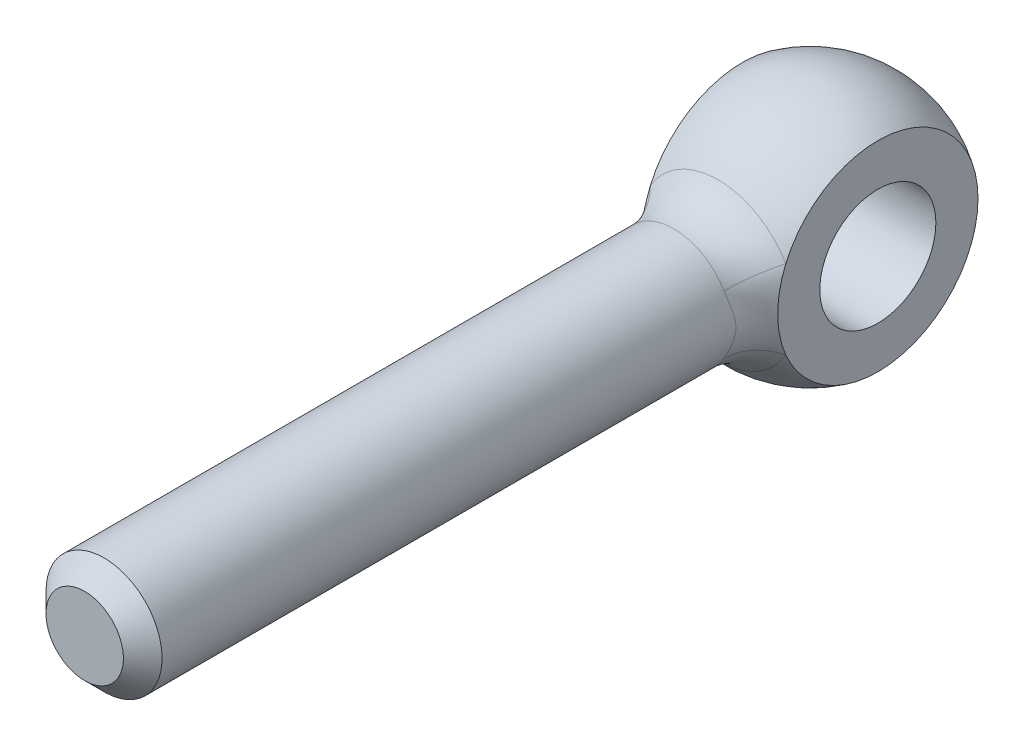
ISO-10303-21;
HEADER;
FILE_DESCRIPTION(('STEP AP214'),'2;1');
FILE_NAME('part.step','',(''),(''),'','','');
FILE_SCHEMA(('AUTOMOTIVE_DESIGN { 1 0 10303 214 1 1 1 1 }'));
ENDSEC;
DATA;
#1=APPLICATION_CONTEXT('core data for automotive mechanical design processes');
#2=APPLICATION_PROTOCOL_DEFINITION('international standard','automotive_design',2000,#1);
#3=PRODUCT_CONTEXT('',#1,'mechanical');
#4=PRODUCT('Part','Part','',(#3));
#5=PRODUCT_RELATED_PRODUCT_CATEGORY('part','',(#4));
#6=PRODUCT_DEFINITION_FORMATION('','',#4);
#7=PRODUCT_DEFINITION_CONTEXT('part definition',#1,'design');
#8=PRODUCT_DEFINITION('design','',#6,#7);
#9=PRODUCT_DEFINITION_SHAPE('','',#8);
#10=(LENGTH_UNIT() NAMED_UNIT(*) SI_UNIT(.MILLI.,.METRE.));
#11=(NAMED_UNIT(*) PLANE_ANGLE_UNIT() SI_UNIT($,.RADIAN.));
#12=(NAMED_UNIT(*) SI_UNIT($,.STERADIAN.) SOLID_ANGLE_UNIT());
#13=UNCERTAINTY_MEASURE_WITH_UNIT(LENGTH_MEASURE(1.E-05),#10,'distance_accuracy_value','');
#14=(GEOMETRIC_REPRESENTATION_CONTEXT(3) GLOBAL_UNCERTAINTY_ASSIGNED_CONTEXT((#13)) GLOBAL_UNIT_ASSIGNED_CONTEXT((#10,
#11,#12)) REPRESENTATION_CONTEXT('',''));
#15=CARTESIAN_POINT('',(0.,0.,0.));
#16=DIRECTION('',(0.,0.,1.));
#17=DIRECTION('',(1.,0.,0.));
#18=AXIS2_PLACEMENT_3D('',#15,#16,#17);
#19=CARTESIAN_POINT('',(0.,0.,0.));
#20=DIRECTION('',(1.,0.,0.));
#21=DIRECTION('',(0.,0.,-1.));
#22=AXIS2_PLACEMENT_3D('',#19,#20,#21);
#23=SPHERICAL_SURFACE('',#22,12.5);
#24=CARTESIAN_POINT('',(-7.,0.,0.));
#25=DIRECTION('',(-1.,0.,0.));
#26=DIRECTION('',(0.,0.,1.));
#27=AXIS2_PLACEMENT_3D('',#24,#25,#26);
#28=CIRCLE('',#27,10.356157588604);
#29=CARTESIAN_POINT('',(-7.,-4.09162768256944,9.51359989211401));
#30=VERTEX_POINT('',#29);
#31=CARTESIAN_POINT('',(-7.,4.09162768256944,9.51359989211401));
#32=VERTEX_POINT('',#31);
#33=EDGE_CURVE('E65',#30,#32,#28,.F.);
#34=ORIENTED_EDGE('',*,*,#33,.T.);
#35=CARTESIAN_POINT('',(0.,0.,9.51359989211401));
#36=DIRECTION('',(0.,0.,-1.));
#37=DIRECTION('',(-1.,0.,0.));
#38=AXIS2_PLACEMENT_3D('',#35,#36,#37);
#39=CIRCLE('',#38,8.10810810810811);
#40=CARTESIAN_POINT('',(7.,4.09162768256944,9.51359989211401));
#41=VERTEX_POINT('',#40);
#42=EDGE_CURVE('E73',#32,#41,#39,.T.);
#43=ORIENTED_EDGE('',*,*,#42,.T.);
#44=CARTESIAN_POINT('',(7.,0.,0.));
#45=DIRECTION('',(-1.,0.,0.));
#46=DIRECTION('',(0.,0.,1.));
#47=AXIS2_PLACEMENT_3D('',#44,#45,#46);
#48=CIRCLE('',#47,10.356157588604);
#49=CARTESIAN_POINT('',(7.,-4.09162768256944,9.51359989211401));
#50=VERTEX_POINT('',#49);
#51=EDGE_CURVE('E61',#50,#41,#48,.F.);
#52=ORIENTED_EDGE('',*,*,#51,.F.);
#53=CARTESIAN_POINT('',(0.,0.,9.51359989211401));
#54=DIRECTION('',(0.,0.,-1.));
#55=DIRECTION('',(-1.,0.,0.));
#56=AXIS2_PLACEMENT_3D('',#53,#54,#55);
#57=CIRCLE('',#56,8.10810810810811);
#58=EDGE_CURVE('E70',#50,#30,#57,.T.);
#59=ORIENTED_EDGE('',*,*,#58,.T.);
#60=EDGE_LOOP('',(#34,#43,#52,#59));
#61=FACE_BOUND('',#60,.T.);
#62=ADVANCED_FACE('F14',(#61),#23,.T.);
#63=CARTESIAN_POINT('',(0.,0.,-10.));
#64=DIRECTION('',(0.,0.,-1.));
#65=DIRECTION('',(-1.,0.,0.));
#66=AXIS2_PLACEMENT_3D('',#63,#64,#65);
#67=CYLINDRICAL_SURFACE('',#66,6.);
#68=CARTESIAN_POINT('',(-7.,-5.52065402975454,8.76198488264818));
#69=CARTESIAN_POINT('',(-4.73347626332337,-3.77093453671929,10.4723797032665));
#70=CARTESIAN_POINT('',(-4.16393928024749,-4.31990852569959,13.7124960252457));
#71=CARTESIAN_POINT('',(-7.,-5.43196771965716,8.81784503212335));
#72=CARTESIAN_POINT('',(-4.75237008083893,-3.73175735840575,10.5424849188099));
#73=CARTESIAN_POINT('',(-4.24629318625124,-4.24055975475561,13.7683625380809));
#74=CARTESIAN_POINT('',(-7.,-5.34113251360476,8.87321411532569));
#75=CARTESIAN_POINT('',(-4.77436164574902,-3.69082707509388,10.6107881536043));
#76=CARTESIAN_POINT('',(-4.32694937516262,-4.15824402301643,13.8171854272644));
#77=CARTESIAN_POINT('',(-7.,-5.15454022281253,8.98290118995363));
#78=CARTESIAN_POINT('',(-4.82415359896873,-3.60403478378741,10.7430059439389));
#79=CARTESIAN_POINT('',(-4.48416075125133,-3.98818699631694,13.901592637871));
#80=CARTESIAN_POINT('',(-7.,-5.05878355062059,9.03721926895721));
#81=CARTESIAN_POINT('',(-4.85191265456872,-3.55821882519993,10.8069099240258));
#82=CARTESIAN_POINT('',(-4.5607162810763,-3.90044615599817,13.9371780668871));
#83=CARTESIAN_POINT('',(-7.,-4.86225075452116,9.14444949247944));
#84=CARTESIAN_POINT('',(-4.91269251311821,-3.46043711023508,10.929551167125));
#85=CARTESIAN_POINT('',(-4.70862752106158,-3.72052921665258,13.9958066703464));
#86=CARTESIAN_POINT('',(-7.,-4.76150508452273,9.19736771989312));
#87=CARTESIAN_POINT('',(-4.94564175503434,-3.4085616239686,10.9883134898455));
#88=CARTESIAN_POINT('',(-4.78000947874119,-3.62838012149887,14.0189176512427));
#89=CARTESIAN_POINT('',(-7.,-4.55392848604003,9.30189435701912));
#90=CARTESIAN_POINT('',(-5.01603086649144,-3.29716736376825,11.1005263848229));
#91=CARTESIAN_POINT('',(-4.91748494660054,-3.43975979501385,14.0539297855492));
#92=CARTESIAN_POINT('',(-7.,-4.44710008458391,9.3535032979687));
#93=CARTESIAN_POINT('',(-5.05343304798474,-3.23771146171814,11.1539919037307));
#94=CARTESIAN_POINT('',(-4.98358062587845,-3.34329036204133,14.0658355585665));
#95=CARTESIAN_POINT('',(-7.,-4.29695862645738,9.42274283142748));
#96=CARTESIAN_POINT('',(-5.10676472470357,-3.15059746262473,11.2230561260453));
#97=CARTESIAN_POINT('',(-5.06977684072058,-3.20923152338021,14.0752452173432));
#98=CARTESIAN_POINT('',(-7.,-4.25653508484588,9.44107582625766));
#99=CARTESIAN_POINT('',(-5.12115703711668,-3.12687435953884,11.2410365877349));
#100=CARTESIAN_POINT('',(-5.09235610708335,-3.17328084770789,14.0770920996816));
#101=CARTESIAN_POINT('',(-7.,-4.17477524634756,9.47751307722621));
#102=CARTESIAN_POINT('',(-5.15031007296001,-3.0782478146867,11.2762248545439));
#103=CARTESIAN_POINT('',(-5.13675282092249,-3.10089882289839,14.0795339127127));
#104=CARTESIAN_POINT('',(-7.,-4.13343888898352,9.49561731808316));
#105=CARTESIAN_POINT('',(-5.16506981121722,-3.05334717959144,11.2934339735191));
#106=CARTESIAN_POINT('',(-5.15857021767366,-3.06446744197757,14.0801287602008));
#107=CARTESIAN_POINT('',(-7.,-3.93727090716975,9.57998716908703));
#108=CARTESIAN_POINT('',(-5.23484389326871,-2.93397708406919,11.3720989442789));
#109=CARTESIAN_POINT('',(-5.2591135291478,-2.89245379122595,14.0801244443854));
#110=CARTESIAN_POINT('',(-7.,-3.77644238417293,9.64471624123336));
#111=CARTESIAN_POINT('',(-5.2919851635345,-2.83149056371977,11.4288485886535));
#112=CARTESIAN_POINT('',(-5.33294423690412,-2.75394693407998,14.0720012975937));
#113=CARTESIAN_POINT('',(-7.,-3.44057965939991,9.76957212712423));
#114=CARTESIAN_POINT('',(-5.40674389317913,-2.60847852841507,11.5309624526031));
#115=CARTESIAN_POINT('',(-5.46944812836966,-2.47178930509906,14.0431824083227));
#116=CARTESIAN_POINT('',(-7.,-3.26553398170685,9.8296951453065));
#117=CARTESIAN_POINT('',(-5.46437197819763,-2.48805001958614,11.5764173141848));
#118=CARTESIAN_POINT('',(-5.53211216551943,-2.3281344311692,14.0224764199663));
#119=CARTESIAN_POINT('',(-7.,-2.89956860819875,9.94381011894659));
#120=CARTESIAN_POINT('',(-5.5762662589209,-2.22857345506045,11.6561394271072));
#121=CARTESIAN_POINT('',(-5.64613166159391,-2.03613701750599,13.9728223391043));
#122=CARTESIAN_POINT('',(-7.,-2.70859175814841,9.99777819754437));
#123=CARTESIAN_POINT('',(-5.63058064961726,-2.08950571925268,11.6904716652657));
#124=CARTESIAN_POINT('',(-5.69744376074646,-1.88777889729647,13.9438435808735));
#125=CARTESIAN_POINT('',(-7.,-2.31090588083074,10.0971127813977));
#126=CARTESIAN_POINT('',(-5.73158522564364,-1.79407236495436,11.7485069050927));
#127=CARTESIAN_POINT('',(-5.78825827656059,-1.58765614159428,13.8830399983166));
#128=CARTESIAN_POINT('',(-7.,-2.10419766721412,10.1424797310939));
#129=CARTESIAN_POINT('',(-5.77837504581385,-1.63766816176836,11.7723070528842));
#130=CARTESIAN_POINT('',(-5.82776130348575,-1.43589168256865,13.8512153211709));
#131=CARTESIAN_POINT('',(-7.,-1.67085359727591,10.222907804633));
#132=CARTESIAN_POINT('',(-5.86150775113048,-1.30600608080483,11.8111628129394));
#133=CARTESIAN_POINT('',(-5.8955793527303,-1.12600155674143,13.7902383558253));
#134=CARTESIAN_POINT('',(-7.,-1.44386631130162,10.257704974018));
#135=CARTESIAN_POINT('',(-5.89771030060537,-1.13021047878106,11.8260828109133));
#136=CARTESIAN_POINT('',(-5.92361308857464,-0.967810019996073,13.7611653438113));
#137=CARTESIAN_POINT('',(-7.,-0.977611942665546,10.3125756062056));
#138=CARTESIAN_POINT('',(-5.95469562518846,-0.767202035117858,11.8481867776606));
#139=CARTESIAN_POINT('',(-5.96692621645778,-0.649309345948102,13.7134560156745));
#140=CARTESIAN_POINT('',(-7.,-0.73834823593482,10.3326530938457));
#141=CARTESIAN_POINT('',(-5.97558995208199,-0.579692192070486,11.8554206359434));
#142=CARTESIAN_POINT('',(-5.98220909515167,-0.489000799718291,13.6948168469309));
#143=CARTESIAN_POINT('',(-7.,-0.254575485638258,10.3558486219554));
#144=CARTESIAN_POINT('',(-5.99967335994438,-0.20019147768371,11.8636655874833));
#145=CARTESIAN_POINT('',(-5.99980579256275,-0.167748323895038,13.6731565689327));
#146=CARTESIAN_POINT('',(-7.,-0.0100795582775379,10.3590049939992));
#147=CARTESIAN_POINT('',(-6.00295430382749,-0.00781203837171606,11.8647087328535));
#148=CARTESIAN_POINT('',(-6.00214892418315,-0.00680665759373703,13.6701001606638));
#149=CARTESIAN_POINT('',(-7.,0.476166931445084,10.3480653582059));
#150=CARTESIAN_POINT('',(-5.99159819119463,0.374022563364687,11.8609024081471));
#151=CARTESIAN_POINT('',(-5.99390260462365,0.314617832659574,13.6804268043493));
#152=CARTESIAN_POINT('',(-7.,0.717917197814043,10.3339675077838));
#153=CARTESIAN_POINT('',(-5.97693421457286,0.563895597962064,11.8560440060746));
#154=CARTESIAN_POINT('',(-5.98331177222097,0.475100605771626,13.6938116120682));
#155=CARTESIAN_POINT('',(-7.,1.17711093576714,10.2914790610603));
#156=CARTESIAN_POINT('',(-5.93280718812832,0.922682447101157,11.8398412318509));
#157=CARTESIAN_POINT('',(-5.95036755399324,0.78481461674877,13.731995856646));
#158=CARTESIAN_POINT('',(-7.,1.39514584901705,10.2639850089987));
#159=CARTESIAN_POINT('',(-5.90419169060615,1.09249311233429,11.8288660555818));
#160=CARTESIAN_POINT('',(-5.92874844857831,0.934149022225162,13.7560718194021));
#161=CARTESIAN_POINT('',(-7.,1.8183964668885,10.1975189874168));
#162=CARTESIAN_POINT('',(-5.8352776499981,1.41926665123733,11.7992510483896));
#163=CARTESIAN_POINT('',(-5.87439634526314,1.23051561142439,13.8099532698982));
#164=CARTESIAN_POINT('',(-7.,2.02361108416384,10.1585460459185));
#165=CARTESIAN_POINT('',(-5.7948774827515,1.57641327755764,11.7805559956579));
#166=CARTESIAN_POINT('',(-5.84166240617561,1.37754759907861,13.8397592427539));
#167=CARTESIAN_POINT('',(-7.,2.41979554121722,10.0715339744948));
#168=CARTESIAN_POINT('',(-5.70553324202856,1.87549175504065,11.7340817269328));
#169=CARTESIAN_POINT('',(-5.76521762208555,1.66881679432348,13.8994060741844));
#170=CARTESIAN_POINT('',(-7.,2.61075717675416,10.0234896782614));
#171=CARTESIAN_POINT('',(-5.65648641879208,2.01749587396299,11.7062202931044));
#172=CARTESIAN_POINT('',(-5.72150051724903,1.81305235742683,13.9292469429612));
#173=CARTESIAN_POINT('',(-7.,2.97823759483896,9.92051035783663));
#174=CARTESIAN_POINT('',(-5.55330052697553,2.28497381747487,11.6404397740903));
#175=CARTESIAN_POINT('',(-5.62324851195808,2.09804332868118,13.9837841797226));
#176=CARTESIAN_POINT('',(-7.,3.15475790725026,9.86557606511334));
#177=CARTESIAN_POINT('',(-5.49908883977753,2.41044201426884,11.6024299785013));
#178=CARTESIAN_POINT('',(-5.56871475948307,2.23879910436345,14.0084810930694));
#179=CARTESIAN_POINT('',(-7.,3.47765739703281,9.75613046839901));
#180=CARTESIAN_POINT('',(-5.39445517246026,2.63320590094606,11.5201628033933));
#181=CARTESIAN_POINT('',(-5.45483407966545,2.50267587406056,14.0464316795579));
#182=CARTESIAN_POINT('',(-7.,3.62530052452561,9.70209213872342));
#183=CARTESIAN_POINT('',(-5.34411434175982,2.73206566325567,11.4767663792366));
#184=CARTESIAN_POINT('',(-5.39646281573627,2.62618577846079,14.0605611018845));
#185=CARTESIAN_POINT('',(-7.,3.91013385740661,9.59083995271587));
#186=CARTESIAN_POINT('',(-5.24470174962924,2.91650977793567,11.3815427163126));
#187=CARTESIAN_POINT('',(-5.27135185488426,2.86906036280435,14.0783371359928));
#188=CARTESIAN_POINT('',(-7.,4.0473271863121,9.53362705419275));
#189=CARTESIAN_POINT('',(-5.19563379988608,3.00201545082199,11.3296558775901));
#190=CARTESIAN_POINT('',(-5.2046146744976,2.98842627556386,14.0819868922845));
#191=CARTESIAN_POINT('',(-7.,4.31290967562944,9.41647692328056));
#192=CARTESIAN_POINT('',(-5.10089049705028,3.16117080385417,11.2175543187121));
#193=CARTESIAN_POINT('',(-5.0627722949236,3.22291536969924,14.0764425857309));
#194=CARTESIAN_POINT('',(-7.,4.44124691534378,9.35652657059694));
#195=CARTESIAN_POINT('',(-5.05526955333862,3.23465246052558,11.1572503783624));
#196=CARTESIAN_POINT('',(-4.98762357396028,3.33801195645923,14.0671785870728));
#197=CARTESIAN_POINT('',(-7.,4.68940217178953,9.23463387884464));
#198=CARTESIAN_POINT('',(-4.96955301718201,3.37092279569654,11.0291198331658));
#199=CARTESIAN_POINT('',(-4.82981665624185,3.56255813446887,14.0336945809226));
#200=CARTESIAN_POINT('',(-7.,4.8092099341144,9.17268926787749));
#201=CARTESIAN_POINT('',(-4.92951762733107,3.43360058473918,10.9612577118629));
#202=CARTESIAN_POINT('',(-4.74714968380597,3.67200088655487,14.0094568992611));
#203=CARTESIAN_POINT('',(-7.,4.92515727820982,9.11003983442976));
#204=CARTESIAN_POINT('',(-4.89339612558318,3.49152887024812,10.8902848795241));
#205=CARTESIAN_POINT('',(-4.66109414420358,3.77812140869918,13.9767461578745));
#206=(BOUNDED_SURFACE() B_SPLINE_SURFACE(3,2,((#68,#69,#70),(#71,#72,#73),(#74,#75,#76),(#77,
#78,#79),(#80,#81,#82),(#83,#84,#85),(#86,#87,#88),(#89,#90,#91),(#92,#93,#94),(#95,#96,#97),
(#98,#99,#100),(#101,#102,#103),(#104,#105,#106),(#107,#108,#109),(#110,#111,#112),(#113,#114,
#115),(#116,#117,#118),(#119,#120,#121),(#122,#123,#124),(#125,#126,#127),(#128,#129,#130),
(#131,#132,#133),(#134,#135,#136),(#137,#138,#139),(#140,#141,#142),(#143,#144,#145),(#146,#147,
#148),(#149,#150,#151),(#152,#153,#154),(#155,#156,#157),(#158,#159,#160),(#161,#162,#163),
(#164,#165,#166),(#167,#168,#169),(#170,#171,#172),(#173,#174,#175),(#176,#177,#178),(#179,#180,
#181),(#182,#183,#184),(#185,#186,#187),(#188,#189,#190),(#191,#192,#193),(#194,#195,#196),
(#197,#198,#199),(#200,#201,#202),(#203,#204,#205)),.UNSPECIFIED.,.F.,.F.,
.F.) B_SPLINE_SURFACE_WITH_KNOTS((4,2,2,2,2,2,2,2,2,2,2,2,2,2,2,2,2,2,2,2,2,2,4),(3,3),(0.,
0.706069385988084,1.41207968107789,2.11421270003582,2.8160561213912,3.07081429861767,
3.32558940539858,4.26615695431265,5.20749141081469,6.15236157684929,7.09718290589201,
8.06395765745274,9.03046796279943,9.9947878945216,10.9592108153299,11.8664791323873,
12.7738242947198,13.6816877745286,14.5894549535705,15.4094238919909,16.2291467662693,
17.0533262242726,17.8784803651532),(0.,1.),
.UNSPECIFIED.) GEOMETRIC_REPRESENTATION_ITEM() RATIONAL_B_SPLINE_SURFACE(((1.,0.874036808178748,
1.),(1.,0.875980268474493,1.),(1.,0.878049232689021,1.),(1.,0.882404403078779,1.),(1.,
0.884690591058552,1.),(1.,0.889433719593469,1.),(1.,0.891889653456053,1.),(1.,0.896934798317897,
1.),(1.,0.899523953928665,1.),(1.,0.903105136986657,1.),(1.,0.904063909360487,1.),(1.,
0.905988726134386,1.),(1.,0.906954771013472,1.),(1.,0.911497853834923,1.),(1.,0.915103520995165,
1.),(1.,0.922211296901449,1.),(1.,0.925713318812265,1.),(1.,0.932445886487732,1.),(1.,
0.935675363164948,1.),(1.,0.941657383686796,1.),(1.,0.944409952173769,1.),(1.,0.949300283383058,
1.),(1.,0.951422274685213,1.),(1.,0.954768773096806,1.),(1.,0.95599352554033,1.),(1.,
0.957408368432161,1.),(1.,0.957600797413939,1.),(1.,0.95693356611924,1.),(1.,0.956073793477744,
1.),(1.,0.953481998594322,1.),(1.,0.951804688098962,1.),(1.,0.947755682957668,1.),(1.,
0.945383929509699,1.),(1.,0.940114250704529,1.),(1.,0.937216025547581,1.),(1.,0.931066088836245,
1.),(1.,0.927814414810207,1.),(1.,0.921446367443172,1.),(1.,0.918347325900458,1.),(1.,
0.912110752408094,1.),(1.,0.908973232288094,1.),(1.,0.902748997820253,1.),(1.,0.899662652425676,
1.),(1.,0.893647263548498,1.),(1.,0.890718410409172,1.),(1.,0.887916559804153,1.))) REPRESENTATION_ITEM('') SURFACE());
#207=CARTESIAN_POINT('',(-4.66109414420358,3.77812140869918,13.9767461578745));
#208=CARTESIAN_POINT('',(-4.74714968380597,3.67200088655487,14.0094568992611));
#209=CARTESIAN_POINT('',(-4.82981665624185,3.56255813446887,14.0336945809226));
#210=CARTESIAN_POINT('',(-4.98762357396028,3.33801195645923,14.0671785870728));
#211=CARTESIAN_POINT('',(-5.0627722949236,3.22291536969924,14.0764425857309));
#212=CARTESIAN_POINT('',(-5.2046146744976,2.98842627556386,14.0819868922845));
#213=CARTESIAN_POINT('',(-5.27135185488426,2.86906036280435,14.0783371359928));
#214=CARTESIAN_POINT('',(-5.39646281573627,2.62618577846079,14.0605611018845));
#215=CARTESIAN_POINT('',(-5.45483407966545,2.50267587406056,14.0464316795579));
#216=CARTESIAN_POINT('',(-5.56871475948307,2.23879910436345,14.0084810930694));
#217=CARTESIAN_POINT('',(-5.62324851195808,2.09804332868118,13.9837841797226));
#218=CARTESIAN_POINT('',(-5.72150051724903,1.81305235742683,13.9292469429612));
#219=CARTESIAN_POINT('',(-5.76521762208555,1.66881679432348,13.8994060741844));
#220=CARTESIAN_POINT('',(-5.84166240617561,1.37754759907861,13.8397592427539));
#221=CARTESIAN_POINT('',(-5.87439634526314,1.23051561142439,13.8099532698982));
#222=CARTESIAN_POINT('',(-5.92874844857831,0.934149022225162,13.7560718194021));
#223=CARTESIAN_POINT('',(-5.95036755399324,0.78481461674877,13.731995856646));
#224=CARTESIAN_POINT('',(-5.98331177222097,0.475100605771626,13.6938116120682));
#225=CARTESIAN_POINT('',(-5.99390260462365,0.314617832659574,13.6804268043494));
#226=CARTESIAN_POINT('',(-6.00214892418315,-0.00680665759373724,13.6701001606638));
#227=CARTESIAN_POINT('',(-5.99980579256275,-0.167748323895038,13.6731565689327));
#228=CARTESIAN_POINT('',(-5.98220909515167,-0.48900079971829,13.6948168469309));
#229=CARTESIAN_POINT('',(-5.96692621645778,-0.649309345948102,13.7134560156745));
#230=CARTESIAN_POINT('',(-5.92361308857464,-0.967810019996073,13.7611653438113));
#231=CARTESIAN_POINT('',(-5.8955793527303,-1.12600155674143,13.7902383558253));
#232=CARTESIAN_POINT('',(-5.82776130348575,-1.43589168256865,13.8512153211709));
#233=CARTESIAN_POINT('',(-5.78825827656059,-1.58765614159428,13.8830399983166));
#234=CARTESIAN_POINT('',(-5.69744376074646,-1.88777889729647,13.9438435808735));
#235=CARTESIAN_POINT('',(-5.64613166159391,-2.03613701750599,13.9728223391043));
#236=CARTESIAN_POINT('',(-5.53211216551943,-2.3281344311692,14.0224764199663));
#237=CARTESIAN_POINT('',(-5.46944812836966,-2.47178930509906,14.0431824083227));
#238=CARTESIAN_POINT('',(-5.33294423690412,-2.75394693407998,14.0720012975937));
#239=CARTESIAN_POINT('',(-5.25911352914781,-2.89245379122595,14.0801244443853));
#240=CARTESIAN_POINT('',(-5.15857021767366,-3.06446744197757,14.0801287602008));
#241=CARTESIAN_POINT('',(-5.13675282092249,-3.10089882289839,14.0795339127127));
#242=CARTESIAN_POINT('',(-5.09235610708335,-3.17328084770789,14.0770920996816));
#243=CARTESIAN_POINT('',(-5.06977684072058,-3.20923152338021,14.0752452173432));
#244=CARTESIAN_POINT('',(-4.98358062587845,-3.34329036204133,14.0658355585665));
#245=CARTESIAN_POINT('',(-4.91748494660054,-3.43975979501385,14.0539297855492));
#246=CARTESIAN_POINT('',(-4.78000947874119,-3.62838012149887,14.0189176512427));
#247=CARTESIAN_POINT('',(-4.70862752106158,-3.72052921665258,13.9958066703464));
#248=CARTESIAN_POINT('',(-4.5607162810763,-3.90044615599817,13.9371780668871));
#249=CARTESIAN_POINT('',(-4.48416075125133,-3.98818699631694,13.901592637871));
#250=CARTESIAN_POINT('',(-4.32694937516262,-4.15824402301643,13.8171854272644));
#251=CARTESIAN_POINT('',(-4.24629318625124,-4.2405597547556,13.7683625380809));
#252=CARTESIAN_POINT('',(-4.16393928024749,-4.31990852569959,13.7124960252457));
#253=B_SPLINE_CURVE_WITH_KNOTS('',3,(#207,#208,#209,#210,#211,#212,#213,#214,#215,#216,#217,
#218,#219,#220,#221,#222,#223,#224,#225,#226,#227,#228,#229,#230,#231,#232,#233,#234,#235,#236,
#237,#238,#239,#240,#241,#242,#243,#244,#245,#246,#247,#248,#249,#250,#251,#252),.UNSPECIFIED.,
.F.,.F.,(4,2,2,2,2,2,2,2,2,2,2,2,2,2,2,2,2,2,2,2,2,2,4),(0.,0.825154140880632,1.64933359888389,
2.46905647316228,3.28902541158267,4.19679259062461,5.10465607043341,6.01200123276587,
6.9192695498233,7.8836924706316,8.84801240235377,9.81452270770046,10.7812974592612,
11.7261187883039,12.6709889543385,13.6123234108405,14.5528909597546,14.8076660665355,
15.062424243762,15.7642676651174,16.4664006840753,17.1724109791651,17.8784803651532),.UNSPECIFIED.);
#254=CARTESIAN_POINT('',(-5.18,3.02780448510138,14.0801278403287));
#255=VERTEX_POINT('',#254);
#256=CARTESIAN_POINT('',(-5.18,-3.02780448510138,14.0801278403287));
#257=VERTEX_POINT('',#256);
#258=EDGE_CURVE('E88',#255,#257,#253,.T.);
#259=ORIENTED_EDGE('',*,*,#258,.T.);
#260=CARTESIAN_POINT('',(0.,0.,14.0801278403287));
#261=DIRECTION('',(0.,0.,-1.));
#262=DIRECTION('',(-1.,0.,0.));
#263=AXIS2_PLACEMENT_3D('',#260,#261,#262);
#264=CIRCLE('',#263,6.);
#265=CARTESIAN_POINT('',(5.18,-3.02780448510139,14.0801278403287));
#266=VERTEX_POINT('',#265);
#267=EDGE_CURVE('E9',#257,#266,#264,.F.);
#268=ORIENTED_EDGE('',*,*,#267,.T.);
#269=CARTESIAN_POINT('',(7.,5.52065408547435,8.76198484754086));
#270=CARTESIAN_POINT('',(4.73347624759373,3.77093455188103,10.4723796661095));
#271=CARTESIAN_POINT('',(4.16393928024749,4.31990852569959,13.7124960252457));
#272=CARTESIAN_POINT('',(7.,5.43196773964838,8.81784501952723));
#273=CARTESIAN_POINT('',(4.75237007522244,3.73175736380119,10.5424849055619));
#274=CARTESIAN_POINT('',(4.2462931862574,4.24055975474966,13.7683625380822));
#275=CARTESIAN_POINT('',(7.,5.34113251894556,8.87321411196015));
#276=CARTESIAN_POINT('',(4.77436164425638,3.69082707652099,10.6107881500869));
#277=CARTESIAN_POINT('',(4.32694937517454,4.15824402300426,13.8171854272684));
#278=CARTESIAN_POINT('',(7.,5.15454021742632,8.98290119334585));
#279=CARTESIAN_POINT('',(4.82415360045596,3.60403478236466,10.7430059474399));
#280=CARTESIAN_POINT('',(4.48416075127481,3.98818699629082,13.9015926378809));
#281=CARTESIAN_POINT('',(7.,5.05878354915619,9.03721926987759));
#282=CARTESIAN_POINT('',(4.85191265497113,3.55821882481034,10.8069099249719));
#283=CARTESIAN_POINT('',(4.56071628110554,3.90044615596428,13.9371780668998));
#284=CARTESIAN_POINT('',(7.,4.86225075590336,9.14444949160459));
#285=CARTESIAN_POINT('',(4.91269251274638,3.46043711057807,10.9295511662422));
#286=CARTESIAN_POINT('',(4.70862752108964,3.72052921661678,13.9958066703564));
#287=CARTESIAN_POINT('',(7.,4.76150508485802,9.19736771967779));
#288=CARTESIAN_POINT('',(4.9456417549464,3.40856162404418,10.9883134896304));
#289=CARTESIAN_POINT('',(4.78000947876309,3.62838012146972,14.0189176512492));
#290=CARTESIAN_POINT('',(7.,4.55392848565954,9.3018943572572));
#291=CARTESIAN_POINT('',(5.01603086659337,3.29716736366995,11.1005263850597));
#292=CARTESIAN_POINT('',(4.91748494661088,3.43975979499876,14.053929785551));
#293=CARTESIAN_POINT('',(7.,4.44710008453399,9.35350329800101));
#294=CARTESIAN_POINT('',(5.05343304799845,3.2377114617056,11.1539919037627));
#295=CARTESIAN_POINT('',(4.98358062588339,3.34329036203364,14.065835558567));
#296=CARTESIAN_POINT('',(7.,4.29695862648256,9.4227428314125));
#297=CARTESIAN_POINT('',(5.10676472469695,3.15059746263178,11.2230561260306));
#298=CARTESIAN_POINT('',(5.06977684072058,3.20923152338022,14.0752452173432));
#299=CARTESIAN_POINT('',(7.,4.25653508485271,9.44107582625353));
#300=CARTESIAN_POINT('',(5.12115703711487,3.1268743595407,11.2410365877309));
#301=CARTESIAN_POINT('',(5.09235610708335,3.1732808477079,14.0770920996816));
#302=CARTESIAN_POINT('',(7.,4.17477524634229,9.47751307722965));
#303=CARTESIAN_POINT('',(5.15031007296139,3.07824781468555,11.2762248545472));
#304=CARTESIAN_POINT('',(5.13675282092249,3.1008988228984,14.0795339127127));
#305=CARTESIAN_POINT('',(7.,4.13343888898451,9.49561731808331));
#306=CARTESIAN_POINT('',(5.16506981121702,3.05334717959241,11.2934339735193));
#307=CARTESIAN_POINT('',(5.15857021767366,3.06446744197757,14.0801287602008));
#308=CARTESIAN_POINT('',(7.,3.93727090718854,9.57998716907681));
#309=CARTESIAN_POINT('',(5.2348438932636,2.93397708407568,11.3720989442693));
#310=CARTESIAN_POINT('',(5.2591135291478,2.89245379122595,14.0801244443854));
#311=CARTESIAN_POINT('',(7.,3.77644238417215,9.64471624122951));
#312=CARTESIAN_POINT('',(5.2919851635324,2.83149056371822,11.42884858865));
#313=CARTESIAN_POINT('',(5.33294423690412,2.75394693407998,14.0720012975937));
#314=CARTESIAN_POINT('',(7.,3.44057965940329,9.76957212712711));
#315=CARTESIAN_POINT('',(5.40674389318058,2.6084785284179,11.5309624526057));
#316=CARTESIAN_POINT('',(5.46944812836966,2.47178930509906,14.0431824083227));
#317=CARTESIAN_POINT('',(7.,3.26553398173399,9.82969514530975));
#318=CARTESIAN_POINT('',(5.46437197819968,2.48805001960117,11.5764173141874));
#319=CARTESIAN_POINT('',(5.53211216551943,2.32813443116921,14.0224764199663));
#320=CARTESIAN_POINT('',(7.,2.89956860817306,9.94381011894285));
#321=CARTESIAN_POINT('',(5.57626625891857,2.22857345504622,11.6561394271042));
#322=CARTESIAN_POINT('',(5.64613166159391,2.03613701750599,13.9728223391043));
#323=CARTESIAN_POINT('',(7.,2.70859175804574,9.99777819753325));
#324=CARTESIAN_POINT('',(5.63058064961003,2.08950571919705,11.6904716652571));
#325=CARTESIAN_POINT('',(5.69744376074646,1.88777889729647,13.9438435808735));
#326=CARTESIAN_POINT('',(7.,2.31090588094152,10.0971127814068));
#327=CARTESIAN_POINT('',(5.73158522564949,1.79407236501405,11.7485069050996));
#328=CARTESIAN_POINT('',(5.78825827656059,1.58765614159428,13.8830399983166));
#329=CARTESIAN_POINT('',(7.,2.1041976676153,10.1424797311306));
#330=CARTESIAN_POINT('',(5.77837504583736,1.63766816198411,11.7723070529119));
#331=CARTESIAN_POINT('',(5.82776130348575,1.43589168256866,13.8512153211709));
#332=CARTESIAN_POINT('',(7.,1.67085359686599,10.2229078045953));
#333=CARTESIAN_POINT('',(5.86150775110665,1.30600608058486,11.8111628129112));
#334=CARTESIAN_POINT('',(5.8955793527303,1.12600155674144,13.7902383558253));
#335=CARTESIAN_POINT('',(7.,1.4438663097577,10.2577049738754));
#336=CARTESIAN_POINT('',(5.89771030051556,1.1302104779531,11.8260828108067));
#337=CARTESIAN_POINT('',(5.92361308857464,0.967810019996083,13.7611653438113));
#338=CARTESIAN_POINT('',(7.,0.977611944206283,10.3125756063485));
#339=CARTESIAN_POINT('',(5.95469562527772,0.767202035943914,11.8481867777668));
#340=CARTESIAN_POINT('',(5.96692621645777,0.649309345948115,13.7134560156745));
#341=CARTESIAN_POINT('',(7.,0.738348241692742,10.332653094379));
#342=CARTESIAN_POINT('',(5.97558995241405,0.579692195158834,11.8554206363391));
#343=CARTESIAN_POINT('',(5.98220909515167,0.489000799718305,13.6948168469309));
#344=CARTESIAN_POINT('',(7.,0.254575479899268,10.355848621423));
#345=CARTESIAN_POINT('',(5.99967335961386,0.200191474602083,11.8636655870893));
#346=CARTESIAN_POINT('',(5.99980579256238,0.167748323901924,13.6731565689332));
#347=CARTESIAN_POINT('',(7.,0.0100795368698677,10.3590049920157));
#348=CARTESIAN_POINT('',(6.00295430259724,0.00781202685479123,11.8647087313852));
#349=CARTESIAN_POINT('',(6.00214892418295,0.00680665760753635,13.6701001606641));
#350=CARTESIAN_POINT('',(7.,-0.476166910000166,10.3480653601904));
#351=CARTESIAN_POINT('',(5.99159819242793,-0.374022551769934,11.8609024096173));
#352=CARTESIAN_POINT('',(5.99390260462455,-0.314617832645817,13.6804268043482));
#353=CARTESIAN_POINT('',(7.,-0.717917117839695,10.3339675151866));
#354=CARTESIAN_POINT('',(5.97693421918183,-0.563895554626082,11.856044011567));
#355=CARTESIAN_POINT('',(5.9833117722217,-0.475100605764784,13.6938116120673));
#356=CARTESIAN_POINT('',(7.,-1.17711085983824,10.2914790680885));
#357=CARTESIAN_POINT('',(5.93280719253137,-0.922682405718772,11.8398412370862));
#358=CARTESIAN_POINT('',(5.95036755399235,-0.784814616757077,13.731995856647));
#359=CARTESIAN_POINT('',(7.,-1.39514582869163,10.2639850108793));
#360=CARTESIAN_POINT('',(5.90419169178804,-1.0924931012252,11.8288660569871));
#361=CARTESIAN_POINT('',(5.92874844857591,-0.934149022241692,13.7560718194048));
#362=CARTESIAN_POINT('',(7.,-1.81839648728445,10.1975189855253));
#363=CARTESIAN_POINT('',(5.83527764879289,-1.41926666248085,11.7992510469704));
#364=CARTESIAN_POINT('',(5.8743963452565,-1.23051561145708,13.8099532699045));
#365=CARTESIAN_POINT('',(7.,-2.02361108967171,10.1585460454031));
#366=CARTESIAN_POINT('',(5.79487748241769,-1.57641328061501,11.780555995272));
#367=CARTESIAN_POINT('',(5.84166240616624,-1.37754759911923,13.8397592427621));
#368=CARTESIAN_POINT('',(7.,-2.4197955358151,10.0715339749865));
#369=CARTESIAN_POINT('',(5.70553324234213,-1.87549175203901,11.7340817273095));
#370=CARTESIAN_POINT('',(5.76521762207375,-1.66881679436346,13.8994060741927));
#371=CARTESIAN_POINT('',(7.,-2.6107571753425,10.0234896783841));
#372=CARTESIAN_POINT('',(5.65648641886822,-2.01749587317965,11.7062202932));
#373=CARTESIAN_POINT('',(5.72150051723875,-1.81305235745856,13.9292469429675));
#374=CARTESIAN_POINT('',(7.,-2.97823759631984,9.92051035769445));
#375=CARTESIAN_POINT('',(5.55330052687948,-2.28497381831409,11.6404397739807));
#376=CARTESIAN_POINT('',(5.62324851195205,-2.09804332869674,13.9837841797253));
#377=CARTESIAN_POINT('',(7.,-3.15475790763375,9.86557606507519));
#378=CARTESIAN_POINT('',(5.49908883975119,-2.41044201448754,11.6024299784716));
#379=CARTESIAN_POINT('',(5.56871475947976,-2.23879910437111,14.0084810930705));
#380=CARTESIAN_POINT('',(7.,-3.4776573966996,9.75613046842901));
#381=CARTESIAN_POINT('',(5.39445517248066,-2.63320590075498,11.5201628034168));
#382=CARTESIAN_POINT('',(5.45483407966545,-2.50267587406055,14.0464316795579));
#383=CARTESIAN_POINT('',(7.,-3.6253005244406,9.7020921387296));
#384=CARTESIAN_POINT('',(5.34411434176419,-2.73206566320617,11.4767663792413));
#385=CARTESIAN_POINT('',(5.39646281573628,-2.62618577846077,14.0605611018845));
#386=CARTESIAN_POINT('',(7.,-3.91013385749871,9.59083995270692));
#387=CARTESIAN_POINT('',(5.24470174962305,-2.91650977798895,11.3815427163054));
#388=CARTESIAN_POINT('',(5.27135185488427,-2.86906036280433,14.0783371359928));
#389=CARTESIAN_POINT('',(7.,-4.0473271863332,9.53362705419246));
#390=CARTESIAN_POINT('',(5.19563379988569,-3.00201545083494,11.3296558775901));
#391=CARTESIAN_POINT('',(5.20461467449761,-2.98842627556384,14.0819868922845));
#392=CARTESIAN_POINT('',(7.,-4.31290967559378,9.41647692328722));
#393=CARTESIAN_POINT('',(5.10089049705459,-3.16117080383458,11.2175543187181));
#394=CARTESIAN_POINT('',(5.06277229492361,-3.22291536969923,14.0764425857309));
#395=CARTESIAN_POINT('',(7.,-4.44124691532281,9.35652657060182));
#396=CARTESIAN_POINT('',(5.05526955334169,-3.23465246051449,11.1572503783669));
#397=CARTESIAN_POINT('',(4.98762357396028,-3.33801195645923,14.0671785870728));
#398=CARTESIAN_POINT('',(7.,-4.68940217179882,9.23463387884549));
#399=CARTESIAN_POINT('',(4.96955301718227,-3.37092279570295,11.0291198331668));
#400=CARTESIAN_POINT('',(4.82981665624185,-3.56255813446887,14.0336945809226));
#401=CARTESIAN_POINT('',(7.,-4.80920993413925,9.17268926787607));
#402=CARTESIAN_POINT('',(4.92951762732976,-3.43360058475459,10.9612577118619));
#403=CARTESIAN_POINT('',(4.74714968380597,-3.67200088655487,14.0094568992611));
#404=CARTESIAN_POINT('',(7.,-4.92515727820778,9.11003983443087));
#405=CARTESIAN_POINT('',(4.89339612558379,-3.49152887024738,10.8902848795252));
#406=CARTESIAN_POINT('',(4.66109414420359,-3.77812140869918,13.9767461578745));
#407=(BOUNDED_SURFACE() B_SPLINE_SURFACE(3,2,((#269,#270,#271),(#272,#273,#274),(#275,#276,
#277),(#278,#279,#280),(#281,#282,#283),(#284,#285,#286),(#287,#288,#289),(#290,#291,#292),
(#293,#294,#295),(#296,#297,#298),(#299,#300,#301),(#302,#303,#304),(#305,#306,#307),(#308,#309,
#310),(#311,#312,#313),(#314,#315,#316),(#317,#318,#319),(#320,#321,#322),(#323,#324,#325),
(#326,#327,#328),(#329,#330,#331),(#332,#333,#334),(#335,#336,#337),(#338,#339,#340),(#341,#342,
#343),(#344,#345,#346),(#347,#348,#349),(#350,#351,#352),(#353,#354,#355),(#356,#357,#358),
(#359,#360,#361),(#362,#363,#364),(#365,#366,#367),(#368,#369,#370),(#371,#372,#373),(#374,#375,
#376),(#377,#378,#379),(#380,#381,#382),(#383,#384,#385),(#386,#387,#388),(#389,#390,#391),
(#392,#393,#394),(#395,#396,#397),(#398,#399,#400),(#401,#402,#403),(#404,#405,#406)),
.UNSPECIFIED.,.F.,.F.,.F.) B_SPLINE_SURFACE_WITH_KNOTS((4,2,2,2,2,2,2,2,2,2,2,2,2,2,2,2,2,2,2,2,
2,2,4),(3,3),(0.,0.706069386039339,1.41207968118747,2.11421270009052,2.81605612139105,
3.07081429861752,3.32558940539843,4.2661569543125,5.20749141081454,6.15236157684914,
7.09718290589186,8.06395765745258,9.03046796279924,9.99478789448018,10.9592108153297,
11.8664791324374,12.7738242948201,13.6816877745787,14.5894549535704,15.4094238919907,
16.2291467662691,17.0533262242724,17.8784803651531),(0.,1.),
.UNSPECIFIED.) GEOMETRIC_REPRESENTATION_ITEM() RATIONAL_B_SPLINE_SURFACE(((1.,0.87403680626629,
1.),(1.,0.875980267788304,1.),(1.,0.878049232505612,1.),(1.,0.882404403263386,1.),(1.,
0.884690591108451,1.),(1.,0.889433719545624,1.),(1.,0.891889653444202,1.),(1.,0.896934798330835,
1.),(1.,0.899523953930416,1.),(1.,0.903105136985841,1.),(1.,0.904063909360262,1.),(1.,
0.905988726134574,1.),(1.,0.906954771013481,1.),(1.,0.91149785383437,1.),(1.,0.91510352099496,
1.),(1.,0.922211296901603,1.),(1.,0.92571331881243,1.),(1.,0.932445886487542,1.),(1.,
0.935675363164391,1.),(1.,0.941657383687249,1.),(1.,0.944409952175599,1.),(1.,0.94930028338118,
1.),(1.,0.9514222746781,1.),(1.,0.954768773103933,1.),(1.,0.955993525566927,1.),(1.,
0.957408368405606,1.),(1.,0.957600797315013,1.),(1.,0.956933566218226,1.),(1.,0.956073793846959,
1.),(1.,0.953481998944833,1.),(1.,0.951804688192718,1.),(1.,0.947755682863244,1.),(1.,
0.945383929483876,1.),(1.,0.940114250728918,1.),(1.,0.937216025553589,1.),(1.,0.931066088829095,
1.),(1.,0.927814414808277,1.),(1.,0.921446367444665,1.),(1.,0.918347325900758,1.),(1.,
0.912110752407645,1.),(1.,0.908973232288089,1.),(1.,0.902748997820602,1.),(1.,0.899662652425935,
1.),(1.,0.893647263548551,1.),(1.,0.890718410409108,1.),(1.,0.887916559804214,1.))) REPRESENTATION_ITEM('') SURFACE());
#408=CARTESIAN_POINT('',(4.66109414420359,-3.77812140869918,13.9767461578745));
#409=CARTESIAN_POINT('',(4.74714968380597,-3.67200088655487,14.0094568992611));
#410=CARTESIAN_POINT('',(4.82981665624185,-3.56255813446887,14.0336945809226));
#411=CARTESIAN_POINT('',(4.98762357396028,-3.33801195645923,14.0671785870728));
#412=CARTESIAN_POINT('',(5.06277229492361,-3.22291536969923,14.0764425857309));
#413=CARTESIAN_POINT('',(5.20461467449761,-2.98842627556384,14.0819868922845));
#414=CARTESIAN_POINT('',(5.27135185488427,-2.86906036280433,14.0783371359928));
#415=CARTESIAN_POINT('',(5.39646281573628,-2.62618577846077,14.0605611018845));
#416=CARTESIAN_POINT('',(5.45483407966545,-2.50267587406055,14.0464316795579));
#417=CARTESIAN_POINT('',(5.56871475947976,-2.23879910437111,14.0084810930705));
#418=CARTESIAN_POINT('',(5.62324851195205,-2.09804332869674,13.9837841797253));
#419=CARTESIAN_POINT('',(5.72150051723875,-1.81305235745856,13.9292469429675));
#420=CARTESIAN_POINT('',(5.76521762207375,-1.66881679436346,13.8994060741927));
#421=CARTESIAN_POINT('',(5.84166240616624,-1.37754759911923,13.8397592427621));
#422=CARTESIAN_POINT('',(5.8743963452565,-1.23051561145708,13.8099532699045));
#423=CARTESIAN_POINT('',(5.92874844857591,-0.934149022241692,13.7560718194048));
#424=CARTESIAN_POINT('',(5.95036755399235,-0.784814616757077,13.731995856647));
#425=CARTESIAN_POINT('',(5.9833117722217,-0.475100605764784,13.6938116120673));
#426=CARTESIAN_POINT('',(5.99390260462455,-0.314617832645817,13.6804268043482));
#427=CARTESIAN_POINT('',(6.00214892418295,0.00680665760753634,13.6701001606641));
#428=CARTESIAN_POINT('',(5.99980579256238,0.167748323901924,13.6731565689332));
#429=CARTESIAN_POINT('',(5.98220909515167,0.489000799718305,13.6948168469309));
#430=CARTESIAN_POINT('',(5.96692621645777,0.649309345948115,13.7134560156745));
#431=CARTESIAN_POINT('',(5.92361308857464,0.967810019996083,13.7611653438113));
#432=CARTESIAN_POINT('',(5.8955793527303,1.12600155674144,13.7902383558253));
#433=CARTESIAN_POINT('',(5.82776130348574,1.43589168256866,13.8512153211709));
#434=CARTESIAN_POINT('',(5.78825827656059,1.58765614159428,13.8830399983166));
#435=CARTESIAN_POINT('',(5.69744376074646,1.88777889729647,13.9438435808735));
#436=CARTESIAN_POINT('',(5.64613166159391,2.03613701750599,13.9728223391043));
#437=CARTESIAN_POINT('',(5.53211216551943,2.32813443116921,14.0224764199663));
#438=CARTESIAN_POINT('',(5.46944812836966,2.47178930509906,14.0431824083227));
#439=CARTESIAN_POINT('',(5.33294423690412,2.75394693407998,14.0720012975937));
#440=CARTESIAN_POINT('',(5.2591135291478,2.89245379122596,14.0801244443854));
#441=CARTESIAN_POINT('',(5.15857021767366,3.06446744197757,14.0801287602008));
#442=CARTESIAN_POINT('',(5.13675282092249,3.1008988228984,14.0795339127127));
#443=CARTESIAN_POINT('',(5.09235610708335,3.1732808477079,14.0770920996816));
#444=CARTESIAN_POINT('',(5.06977684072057,3.20923152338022,14.0752452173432));
#445=CARTESIAN_POINT('',(4.98358062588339,3.34329036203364,14.065835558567));
#446=CARTESIAN_POINT('',(4.91748494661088,3.43975979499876,14.053929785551));
#447=CARTESIAN_POINT('',(4.78000947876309,3.62838012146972,14.0189176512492));
#448=CARTESIAN_POINT('',(4.70862752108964,3.72052921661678,13.9958066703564));
#449=CARTESIAN_POINT('',(4.56071628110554,3.90044615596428,13.9371780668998));
#450=CARTESIAN_POINT('',(4.48416075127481,3.98818699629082,13.9015926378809));
#451=CARTESIAN_POINT('',(4.32694937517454,4.15824402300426,13.8171854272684));
#452=CARTESIAN_POINT('',(4.2462931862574,4.24055975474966,13.7683625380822));
#453=CARTESIAN_POINT('',(4.16393928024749,4.31990852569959,13.7124960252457));
#454=B_SPLINE_CURVE_WITH_KNOTS('',3,(#408,#409,#410,#411,#412,#413,#414,#415,#416,#417,#418,
#419,#420,#421,#422,#423,#424,#425,#426,#427,#428,#429,#430,#431,#432,#433,#434,#435,#436,#437,
#438,#439,#440,#441,#442,#443,#444,#445,#446,#447,#448,#449,#450,#451,#452,#453),.UNSPECIFIED.,
.F.,.F.,(4,2,2,2,2,2,2,2,2,2,2,2,2,2,2,2,2,2,2,2,2,2,4),(0.,0.825154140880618,1.64933359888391,
2.46905647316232,3.28902541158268,4.1967925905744,5.104656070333,6.01200123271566,
6.91926954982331,7.88369247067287,8.84801240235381,9.81452270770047,10.7812974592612,
11.7261187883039,12.6709889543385,13.6123234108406,14.5528909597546,14.8076660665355,
15.062424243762,15.7642676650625,16.4664006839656,17.1724109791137,17.8784803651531),.UNSPECIFIED.);
#455=CARTESIAN_POINT('',(5.18,3.02780448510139,14.0801278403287));
#456=VERTEX_POINT('',#455);
#457=EDGE_CURVE('E27',#266,#456,#454,.T.);
#458=ORIENTED_EDGE('',*,*,#457,.T.);
#459=CARTESIAN_POINT('',(0.,0.,14.0801278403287));
#460=DIRECTION('',(0.,0.,-1.));
#461=DIRECTION('',(-1.,0.,0.));
#462=AXIS2_PLACEMENT_3D('',#459,#460,#461);
#463=CIRCLE('',#462,6.);
#464=EDGE_CURVE('E101',#456,#255,#463,.F.);
#465=ORIENTED_EDGE('',*,*,#464,.T.);
#466=EDGE_LOOP('',(#259,#268,#458,#465));
#467=FACE_BOUND('',#466,.T.);
#468=CARTESIAN_POINT('',(0.,0.,73.));
#469=DIRECTION('',(0.,0.,-1.));
#470=DIRECTION('',(-1.,0.,0.));
#471=AXIS2_PLACEMENT_3D('',#468,#469,#470);
#472=CIRCLE('',#471,6.);
#473=CARTESIAN_POINT('',(-6.,0.,73.));
#474=VERTEX_POINT('',#473);
#475=EDGE_CURVE('E86',#474,#474,#472,.T.);
#476=ORIENTED_EDGE('',*,*,#475,.T.);
#477=EDGE_LOOP('',(#476));
#478=FACE_BOUND('',#477,.T.);
#479=ADVANCED_FACE('F107',(#467,#478),#67,.T.);
#480=CARTESIAN_POINT('',(0.,0.,75.));
#481=DIRECTION('',(0.,0.,-1.));
#482=DIRECTION('',(-1.,0.,0.));
#483=AXIS2_PLACEMENT_3D('',#480,#481,#482);
#484=CONICAL_SURFACE('',#483,4.,0.785398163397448);
#485=ORIENTED_EDGE('',*,*,#475,.F.);
#486=EDGE_LOOP('',(#485));
#487=FACE_BOUND('',#486,.T.);
#488=CARTESIAN_POINT('',(0.,0.,75.));
#489=DIRECTION('',(0.,0.,-1.));
#490=DIRECTION('',(-1.,0.,0.));
#491=AXIS2_PLACEMENT_3D('',#488,#489,#490);
#492=CIRCLE('',#491,4.);
#493=CARTESIAN_POINT('',(-4.,0.,75.));
#494=VERTEX_POINT('',#493);
#495=EDGE_CURVE('E74',#494,#494,#492,.T.);
#496=ORIENTED_EDGE('',*,*,#495,.T.);
#497=EDGE_LOOP('',(#496));
#498=FACE_BOUND('',#497,.T.);
#499=ADVANCED_FACE('F111',(#487,#498),#484,.T.);
#500=CARTESIAN_POINT('',(0.,4.,75.));
#501=DIRECTION('',(0.,0.,1.));
#502=DIRECTION('',(1.,0.,0.));
#503=AXIS2_PLACEMENT_3D('',#500,#501,#502);
#504=PLANE('',#503);
#505=ORIENTED_EDGE('',*,*,#495,.F.);
#506=EDGE_LOOP('',(#505));
#507=FACE_BOUND('',#506,.T.);
#508=ADVANCED_FACE('F159',(#507),#504,.T.);
#509=CARTESIAN_POINT('',(7.,-15.,-19.9999999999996));
#510=DIRECTION('',(-1.,0.,0.));
#511=DIRECTION('',(0.,0.,1.));
#512=AXIS2_PLACEMENT_3D('',#509,#510,#511);
#513=PLANE('',#512);
#514=ORIENTED_EDGE('',*,*,#51,.T.);
#515=EDGE_CURVE('E57',#41,#50,#48,.F.);
#516=ORIENTED_EDGE('',*,*,#515,.T.);
#517=EDGE_LOOP('',(#514,#516));
#518=FACE_BOUND('',#517,.T.);
#519=CARTESIAN_POINT('',(7.,0.,0.));
#520=DIRECTION('',(1.,0.,0.));
#521=DIRECTION('',(0.,0.,-1.));
#522=AXIS2_PLACEMENT_3D('',#519,#520,#521);
#523=CIRCLE('',#522,6.);
#524=CARTESIAN_POINT('',(7.,0.,-6.));
#525=VERTEX_POINT('',#524);
#526=EDGE_CURVE('E249',#525,#525,#523,.T.);
#527=ORIENTED_EDGE('',*,*,#526,.F.);
#528=EDGE_LOOP('',(#527));
#529=FACE_BOUND('',#528,.T.);
#530=ADVANCED_FACE('F59',(#518,#529),#513,.F.);
#531=CARTESIAN_POINT('',(-7.,-15.,-19.9999999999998));
#532=DIRECTION('',(-1.,0.,0.));
#533=DIRECTION('',(0.,0.,1.));
#534=AXIS2_PLACEMENT_3D('',#531,#532,#533);
#535=PLANE('',#534);
#536=ORIENTED_EDGE('',*,*,#33,.F.);
#537=EDGE_CURVE('E79',#32,#30,#28,.F.);
#538=ORIENTED_EDGE('',*,*,#537,.F.);
#539=EDGE_LOOP('',(#536,#538));
#540=FACE_BOUND('',#539,.T.);
#541=CARTESIAN_POINT('',(-7.,0.,0.));
#542=DIRECTION('',(-1.,0.,0.));
#543=DIRECTION('',(0.,0.,1.));
#544=AXIS2_PLACEMENT_3D('',#541,#542,#543);
#545=CIRCLE('',#544,6.);
#546=CARTESIAN_POINT('',(-7.,0.,6.));
#547=VERTEX_POINT('',#546);
#548=EDGE_CURVE('E138',#547,#547,#545,.F.);
#549=ORIENTED_EDGE('',*,*,#548,.T.);
#550=EDGE_LOOP('',(#549));
#551=FACE_BOUND('',#550,.T.);
#552=ADVANCED_FACE('F126',(#540,#551),#535,.T.);
#553=CARTESIAN_POINT('',(10.36,6.05560897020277,14.0801278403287));
#554=DIRECTION('',(-0.50463408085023,0.863333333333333,0.));
#555=DIRECTION('',(0.863333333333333,0.50463408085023,0.));
#556=AXIS2_PLACEMENT_3D('',#553,#554,#555);
#557=CIRCLE('',#556,6.);
#558=EDGE_CURVE('E80',#456,#41,#557,.F.);
#559=ORIENTED_EDGE('',*,*,#558,.F.);
#560=ORIENTED_EDGE('',*,*,#457,.F.);
#561=CARTESIAN_POINT('',(10.36,-6.05560897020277,14.0801278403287));
#562=DIRECTION('',(0.504634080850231,0.863333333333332,0.));
#563=DIRECTION('',(0.863333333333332,-0.504634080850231,0.));
#564=AXIS2_PLACEMENT_3D('',#561,#562,#563);
#565=CIRCLE('',#564,6.);
#566=EDGE_CURVE('E76',#50,#266,#565,.T.);
#567=ORIENTED_EDGE('',*,*,#566,.F.);
#568=ORIENTED_EDGE('',*,*,#515,.F.);
#569=EDGE_LOOP('',(#559,#560,#567,#568));
#570=FACE_BOUND('',#569,.T.);
#571=ADVANCED_FACE('F77',(#570),#407,.F.);
#572=CARTESIAN_POINT('',(0.,0.,14.0801278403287));
#573=DIRECTION('',(0.,0.,-1.));
#574=DIRECTION('',(-1.,0.,0.));
#575=AXIS2_PLACEMENT_3D('',#572,#573,#574);
#576=TOROIDAL_SURFACE('',#575,12.,6.);
#577=ORIENTED_EDGE('',*,*,#566,.T.);
#578=ORIENTED_EDGE('',*,*,#267,.F.);
#579=CARTESIAN_POINT('',(-10.36,-6.05560897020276,14.0801278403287));
#580=DIRECTION('',(0.50463408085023,-0.863333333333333,0.));
#581=DIRECTION('',(-0.863333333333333,-0.50463408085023,0.));
#582=AXIS2_PLACEMENT_3D('',#579,#580,#581);
#583=CIRCLE('',#582,6.);
#584=EDGE_CURVE('E84',#30,#257,#583,.T.);
#585=ORIENTED_EDGE('',*,*,#584,.F.);
#586=ORIENTED_EDGE('',*,*,#58,.F.);
#587=EDGE_LOOP('',(#577,#578,#585,#586));
#588=FACE_BOUND('',#587,.T.);
#589=ADVANCED_FACE('F83',(#588),#576,.F.);
#590=CARTESIAN_POINT('',(0.,0.,14.0801278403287));
#591=DIRECTION('',(0.,0.,-1.));
#592=DIRECTION('',(-1.,0.,0.));
#593=AXIS2_PLACEMENT_3D('',#590,#591,#592);
#594=TOROIDAL_SURFACE('',#593,12.,6.);
#595=ORIENTED_EDGE('',*,*,#558,.T.);
#596=ORIENTED_EDGE('',*,*,#42,.F.);
#597=CARTESIAN_POINT('',(-10.36,6.05560897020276,14.0801278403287));
#598=DIRECTION('',(0.50463408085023,0.863333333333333,0.));
#599=DIRECTION('',(0.863333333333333,-0.50463408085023,0.));
#600=AXIS2_PLACEMENT_3D('',#597,#598,#599);
#601=CIRCLE('',#600,6.);
#602=EDGE_CURVE('E136',#255,#32,#601,.T.);
#603=ORIENTED_EDGE('',*,*,#602,.F.);
#604=ORIENTED_EDGE('',*,*,#464,.F.);
#605=EDGE_LOOP('',(#595,#596,#603,#604));
#606=FACE_BOUND('',#605,.T.);
#607=ADVANCED_FACE('F218',(#606),#594,.F.);
#608=ORIENTED_EDGE('',*,*,#584,.T.);
#609=ORIENTED_EDGE('',*,*,#258,.F.);
#610=ORIENTED_EDGE('',*,*,#602,.T.);
#611=ORIENTED_EDGE('',*,*,#537,.T.);
#612=EDGE_LOOP('',(#608,#609,#610,#611));
#613=FACE_BOUND('',#612,.T.);
#614=ADVANCED_FACE('F116',(#613),#206,.F.);
#615=CARTESIAN_POINT('',(-29.2179076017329,0.,0.));
#616=DIRECTION('',(1.,0.,0.));
#617=DIRECTION('',(0.,0.,-1.));
#618=AXIS2_PLACEMENT_3D('',#615,#616,#617);
#619=CYLINDRICAL_SURFACE('',#618,6.);
#620=ORIENTED_EDGE('',*,*,#526,.T.);
#621=EDGE_LOOP('',(#620));
#622=FACE_BOUND('',#621,.T.);
#623=ORIENTED_EDGE('',*,*,#548,.F.);
#624=EDGE_LOOP('',(#623));
#625=FACE_BOUND('',#624,.T.);
#626=ADVANCED_FACE('F156',(#622,#625),#619,.F.);
#627=CLOSED_SHELL('',(#62,#479,#499,#508,#530,#552,#571,#589,#607,#614,#626));
#628=MANIFOLD_SOLID_BREP('B1',#627);
#629=ADVANCED_BREP_SHAPE_REPRESENTATION('',(#18,#628),#14);
#630=SHAPE_DEFINITION_REPRESENTATION(#9,#629);
ENDSEC;
END-ISO-10303-21;
